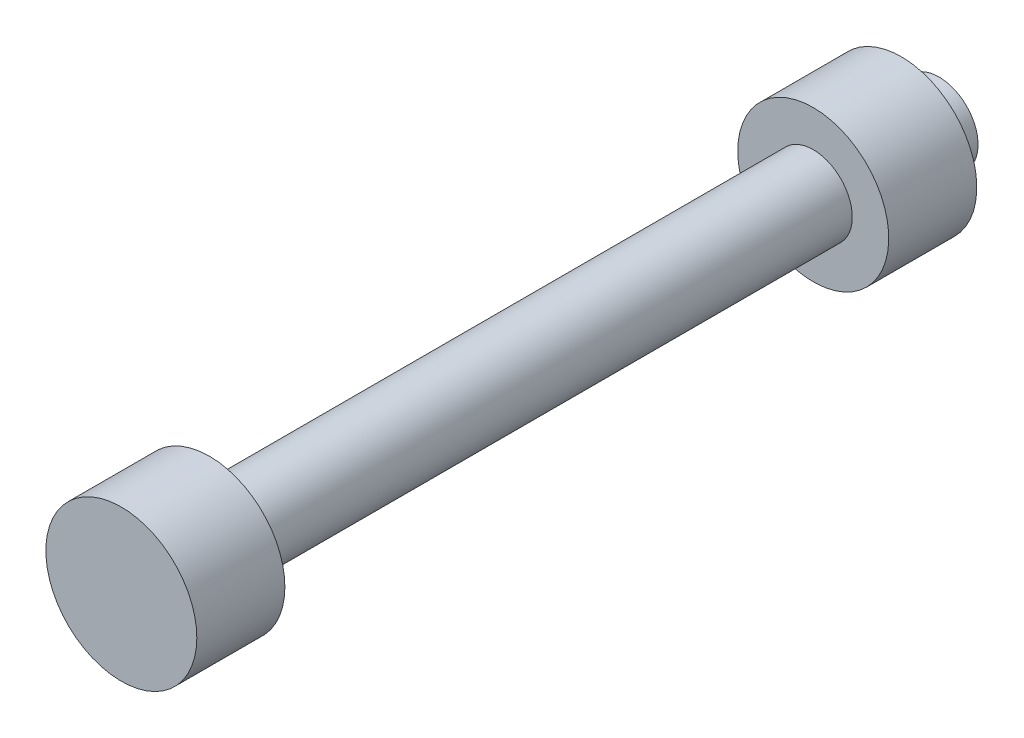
from build123d import *

# Parameters (mm, degrees)
SKETCH1_R           = 9.525
BOSS_EXTRUDE1_DEPTH = 11.1125
SKETCH2_R           = 4.92379
BOSS_EXTRUDE2_DEPTH = 92.075
SKETCH3_R           = 9.525
BOSS_EXTRUDE3_DEPTH = 11.1125


with BuildPart() as part:
    # Sketch1 → Boss-Extrude1 (new body)
    with BuildSketch(Plane.XY):
        Circle(SKETCH1_R)
    extrude(amount=-BOSS_EXTRUDE1_DEPTH)

    # Sketch2 → Boss-Extrude2 (add)
    with BuildSketch(Plane(origin=(0, 0, -11.1125), x_dir=(-1, 0, 0), z_dir=(0, 0, -1))):
        Circle(SKETCH2_R)
    extrude(amount=BOSS_EXTRUDE2_DEPTH)

    # Sketch3 → Boss-Extrude3 (add)
    with BuildSketch(Plane(origin=(0, 0, -87.3125), x_dir=(-1, 0, 0), z_dir=(0, 0, -1))):
        with Locations(Location((0, 0, 0), (0, 0, 180))):
            Circle(SKETCH3_R)
    extrude(amount=BOSS_EXTRUDE3_DEPTH)


solid = part.part
